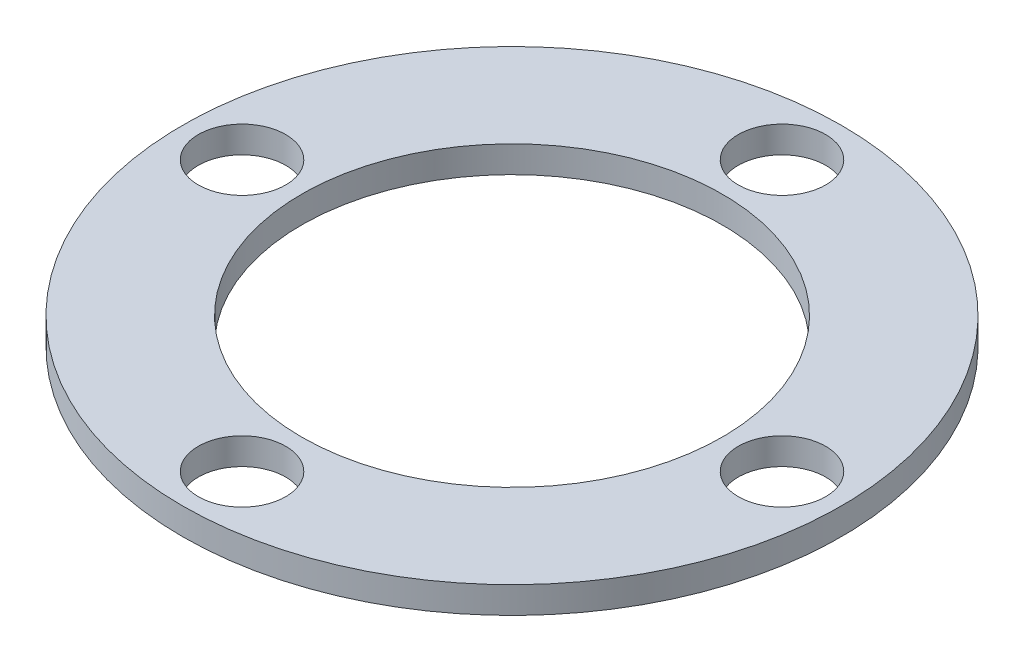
from build123d import *

# Parameters (mm, degrees)
SKETCH1_R         = 32.9438
SKETCH1_R_2       = 21.0312
EXTRUDE1_DEPTH    = 2.667
HOLE1_D           = 8.7376
CIRPATTERN1_COUNT = 4


with BuildPart() as part:
    # Sketch1 → Extrude1 (new body)
    with BuildSketch(Plane(origin=(0, 0, 0), x_dir=(1, 0, 0), z_dir=(0, 1, 0))):
        with Locations(Location((0, 0, 0), (0, 0, 270))):
            Circle(SKETCH1_R)
        with Locations(Location((0, 0, 0), (0, 0, 270))):
            Circle(SKETCH1_R_2, mode=Mode.SUBTRACT)
    extrude(amount=EXTRUDE1_DEPTH)

    # Hole1 (through all)
    with Locations(Plane(origin=(0, 2.667, 0), x_dir=(-1, 0, 0), z_dir=(0, 1, 0))):
        with Locations((0, -26.9875)):
            hole1 = Hole(HOLE1_D / 2)

    # CirPattern1: Hole1 ×4 about axis
    cirpattern1_axis = Axis((0, 0, 0), (0, 1, 0))
    for i in range(1, CIRPATTERN1_COUNT):
        add(hole1.rotate(cirpattern1_axis, i * 360 / CIRPATTERN1_COUNT), mode=Mode.SUBTRACT)


solid = part.part
